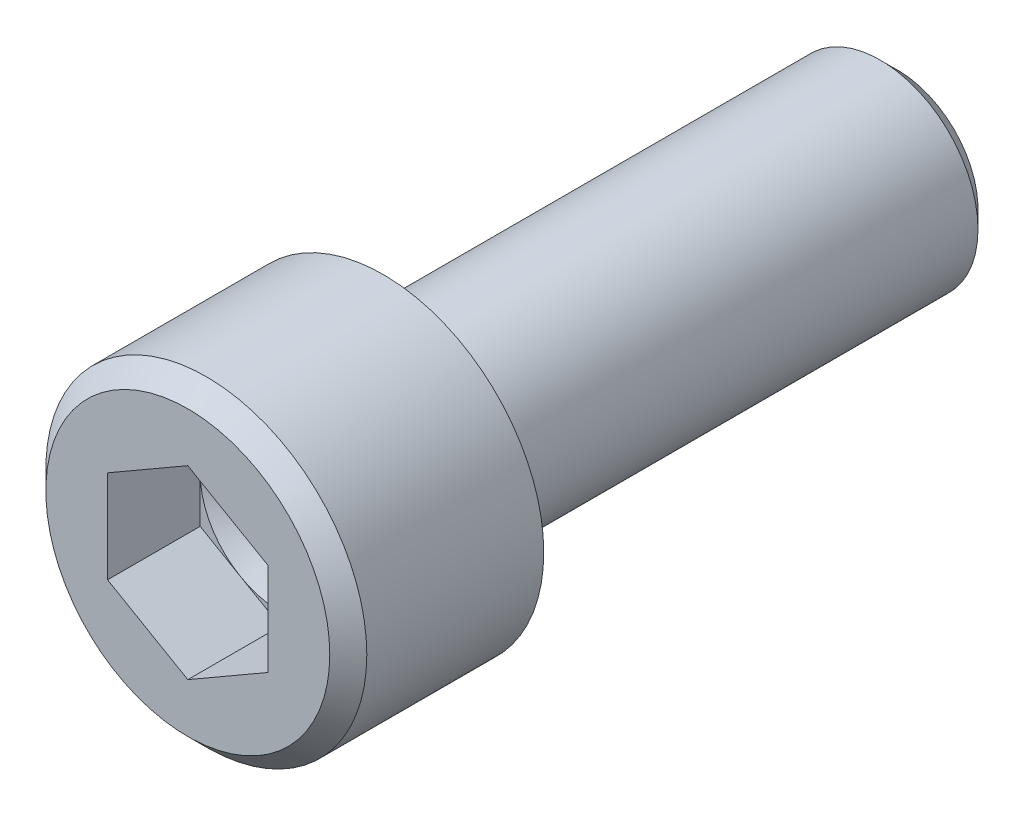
ISO-10303-21;
HEADER;
FILE_DESCRIPTION(('STEP AP214'),'2;1');
FILE_NAME('part.step','',(''),(''),'','','');
FILE_SCHEMA(('AUTOMOTIVE_DESIGN { 1 0 10303 214 1 1 1 1 }'));
ENDSEC;
DATA;
#1=APPLICATION_CONTEXT('core data for automotive mechanical design processes');
#2=APPLICATION_PROTOCOL_DEFINITION('international standard','automotive_design',2000,#1);
#3=PRODUCT_CONTEXT('',#1,'mechanical');
#4=PRODUCT('Part','Part','',(#3));
#5=PRODUCT_RELATED_PRODUCT_CATEGORY('part','',(#4));
#6=PRODUCT_DEFINITION_FORMATION('','',#4);
#7=PRODUCT_DEFINITION_CONTEXT('part definition',#1,'design');
#8=PRODUCT_DEFINITION('design','',#6,#7);
#9=PRODUCT_DEFINITION_SHAPE('','',#8);
#10=(LENGTH_UNIT() NAMED_UNIT(*) SI_UNIT(.MILLI.,.METRE.));
#11=(NAMED_UNIT(*) PLANE_ANGLE_UNIT() SI_UNIT($,.RADIAN.));
#12=(NAMED_UNIT(*) SI_UNIT($,.STERADIAN.) SOLID_ANGLE_UNIT());
#13=UNCERTAINTY_MEASURE_WITH_UNIT(LENGTH_MEASURE(1.E-05),#10,'distance_accuracy_value','');
#14=(GEOMETRIC_REPRESENTATION_CONTEXT(3) GLOBAL_UNCERTAINTY_ASSIGNED_CONTEXT((#13)) GLOBAL_UNIT_ASSIGNED_CONTEXT((#10,
#11,#12)) REPRESENTATION_CONTEXT('',''));
#15=CARTESIAN_POINT('',(0.,0.,0.));
#16=DIRECTION('',(0.,0.,1.));
#17=DIRECTION('',(1.,0.,0.));
#18=AXIS2_PLACEMENT_3D('',#15,#16,#17);
#19=CARTESIAN_POINT('',(0.,0.,-12.7));
#20=DIRECTION('',(0.,0.,1.));
#21=DIRECTION('',(1.,0.,0.));
#22=AXIS2_PLACEMENT_3D('',#19,#20,#21);
#23=CONICAL_SURFACE('',#22,1.98405761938,0.785398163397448);
#24=CARTESIAN_POINT('',(0.,0.,-12.7));
#25=DIRECTION('',(0.,0.,-1.));
#26=DIRECTION('',(-1.,0.,0.));
#27=AXIS2_PLACEMENT_3D('',#24,#25,#26);
#28=CIRCLE('',#27,1.98405761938);
#29=CARTESIAN_POINT('',(-1.98405761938,0.,-12.7));
#30=VERTEX_POINT('',#29);
#31=EDGE_CURVE('E11',#30,#30,#28,.T.);
#32=ORIENTED_EDGE('',*,*,#31,.F.);
#33=EDGE_LOOP('',(#32));
#34=FACE_BOUND('',#33,.T.);
#35=CARTESIAN_POINT('',(0.,0.,-12.27105761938));
#36=DIRECTION('',(0.,0.,1.));
#37=DIRECTION('',(-1.,0.,0.));
#38=AXIS2_PLACEMENT_3D('',#35,#36,#37);
#39=CIRCLE('',#38,2.413);
#40=CARTESIAN_POINT('',(-2.413,0.,-12.27105761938));
#41=VERTEX_POINT('',#40);
#42=EDGE_CURVE('E272',#41,#41,#39,.T.);
#43=ORIENTED_EDGE('',*,*,#42,.F.);
#44=EDGE_LOOP('',(#43));
#45=FACE_BOUND('',#44,.T.);
#46=ADVANCED_FACE('F17',(#34,#45),#23,.T.);
#47=CARTESIAN_POINT('',(0.,0.,-0.1524));
#48=DIRECTION('',(0.,0.,1.));
#49=DIRECTION('',(1.,0.,0.));
#50=AXIS2_PLACEMENT_3D('',#47,#48,#49);
#51=TOROIDAL_SURFACE('',#50,2.5654,0.1524);
#52=CARTESIAN_POINT('',(0.,0.,-0.1524));
#53=DIRECTION('',(0.,0.,-1.));
#54=DIRECTION('',(1.,0.,0.));
#55=AXIS2_PLACEMENT_3D('',#52,#53,#54);
#56=CIRCLE('',#55,2.413);
#57=CARTESIAN_POINT('',(2.413,0.,-0.1524));
#58=VERTEX_POINT('',#57);
#59=EDGE_CURVE('E27',#58,#58,#56,.T.);
#60=ORIENTED_EDGE('',*,*,#59,.F.);
#61=EDGE_LOOP('',(#60));
#62=FACE_BOUND('',#61,.T.);
#63=CARTESIAN_POINT('',(0.,0.,0.));
#64=DIRECTION('',(0.,0.,1.));
#65=DIRECTION('',(1.,0.,0.));
#66=AXIS2_PLACEMENT_3D('',#63,#64,#65);
#67=CIRCLE('',#66,2.5654);
#68=CARTESIAN_POINT('',(2.5654,0.,0.));
#69=VERTEX_POINT('',#68);
#70=EDGE_CURVE('E176',#69,#69,#67,.T.);
#71=ORIENTED_EDGE('',*,*,#70,.F.);
#72=EDGE_LOOP('',(#71));
#73=FACE_BOUND('',#72,.T.);
#74=ADVANCED_FACE('F19',(#62,#73),#51,.F.);
#75=CARTESIAN_POINT('',(0.,0.,1001.39615364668));
#76=DIRECTION('',(0.,0.,1.));
#77=DIRECTION('',(1.,0.,0.));
#78=AXIS2_PLACEMENT_3D('',#75,#76,#77);
#79=CONICAL_SURFACE('',#78,1732.05080756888,1.0471975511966);
#80=CARTESIAN_POINT('',(0.,0.,1.39615364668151));
#81=VERTEX_POINT('',#80);
#82=VERTEX_LOOP('',#81);
#83=FACE_BOUND('',#82,.T.);
#84=CARTESIAN_POINT('',(0.,0.,2.54));
#85=DIRECTION('',(0.,0.,-1.));
#86=DIRECTION('',(-1.,0.,0.));
#87=AXIS2_PLACEMENT_3D('',#84,#85,#86);
#88=CIRCLE('',#87,1.9812);
#89=CARTESIAN_POINT('',(-1.9812,0.,2.54));
#90=VERTEX_POINT('',#89);
#91=CARTESIAN_POINT('',(-0.9906,1.71576952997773,2.54));
#92=VERTEX_POINT('',#91);
#93=EDGE_CURVE('E148',#90,#92,#88,.T.);
#94=ORIENTED_EDGE('',*,*,#93,.F.);
#95=CARTESIAN_POINT('',(0.,0.,2.54));
#96=DIRECTION('',(0.,0.,-1.));
#97=DIRECTION('',(-1.,0.,0.));
#98=AXIS2_PLACEMENT_3D('',#95,#96,#97);
#99=CIRCLE('',#98,1.9812);
#100=CARTESIAN_POINT('',(-0.9906,-1.71576952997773,2.54));
#101=VERTEX_POINT('',#100);
#102=EDGE_CURVE('E135',#101,#90,#99,.T.);
#103=ORIENTED_EDGE('',*,*,#102,.F.);
#104=CARTESIAN_POINT('',(0.,0.,2.54));
#105=DIRECTION('',(0.,0.,-1.));
#106=DIRECTION('',(-1.,0.,0.));
#107=AXIS2_PLACEMENT_3D('',#104,#105,#106);
#108=CIRCLE('',#107,1.9812);
#109=CARTESIAN_POINT('',(0.9906,-1.71576952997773,2.54));
#110=VERTEX_POINT('',#109);
#111=EDGE_CURVE('E216',#110,#101,#108,.T.);
#112=ORIENTED_EDGE('',*,*,#111,.F.);
#113=CARTESIAN_POINT('',(0.,0.,2.54));
#114=DIRECTION('',(0.,0.,-1.));
#115=DIRECTION('',(-1.,0.,0.));
#116=AXIS2_PLACEMENT_3D('',#113,#114,#115);
#117=CIRCLE('',#116,1.9812);
#118=CARTESIAN_POINT('',(1.9812,0.,2.54));
#119=VERTEX_POINT('',#118);
#120=EDGE_CURVE('E170',#119,#110,#117,.T.);
#121=ORIENTED_EDGE('',*,*,#120,.F.);
#122=CARTESIAN_POINT('',(0.,0.,2.54));
#123=DIRECTION('',(0.,0.,-1.));
#124=DIRECTION('',(-1.,0.,0.));
#125=AXIS2_PLACEMENT_3D('',#122,#123,#124);
#126=CIRCLE('',#125,1.9812);
#127=CARTESIAN_POINT('',(0.9906,1.71576952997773,2.54));
#128=VERTEX_POINT('',#127);
#129=EDGE_CURVE('E171',#128,#119,#126,.T.);
#130=ORIENTED_EDGE('',*,*,#129,.F.);
#131=CARTESIAN_POINT('',(0.,0.,2.54));
#132=DIRECTION('',(0.,0.,-1.));
#133=DIRECTION('',(-1.,0.,0.));
#134=AXIS2_PLACEMENT_3D('',#131,#132,#133);
#135=CIRCLE('',#134,1.9812);
#136=EDGE_CURVE('E151',#92,#128,#135,.T.);
#137=ORIENTED_EDGE('',*,*,#136,.F.);
#138=EDGE_LOOP('',(#94,#103,#112,#121,#130,#137));
#139=FACE_BOUND('',#138,.T.);
#140=ADVANCED_FACE('F141',(#83,#139),#79,.F.);
#141=CARTESIAN_POINT('',(0.,0.,-12.7));
#142=DIRECTION('',(0.,0.,-1.));
#143=DIRECTION('',(0.,-1.,0.));
#144=AXIS2_PLACEMENT_3D('',#141,#142,#143);
#145=PLANE('',#144);
#146=ORIENTED_EDGE('',*,*,#31,.T.);
#147=EDGE_LOOP('',(#146));
#148=FACE_BOUND('',#147,.T.);
#149=ADVANCED_FACE('F144',(#148),#145,.T.);
#150=CARTESIAN_POINT('',(0.,0.,-12.7));
#151=DIRECTION('',(0.,0.,1.));
#152=DIRECTION('',(1.,0.,0.));
#153=AXIS2_PLACEMENT_3D('',#150,#151,#152);
#154=CYLINDRICAL_SURFACE('',#153,2.413);
#155=ORIENTED_EDGE('',*,*,#59,.T.);
#156=EDGE_LOOP('',(#155));
#157=FACE_BOUND('',#156,.T.);
#158=ORIENTED_EDGE('',*,*,#42,.T.);
#159=EDGE_LOOP('',(#158));
#160=FACE_BOUND('',#159,.T.);
#161=ADVANCED_FACE('F282',(#157,#160),#154,.T.);
#162=CARTESIAN_POINT('',(0.,0.,2.54));
#163=DIRECTION('',(0.,0.,1.));
#164=DIRECTION('',(1.,0.,0.));
#165=AXIS2_PLACEMENT_3D('',#162,#163,#164);
#166=PLANE('',#165);
#167=DIRECTION('',(-0.866025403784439,0.5,0.));
#168=VECTOR('',#167,1.);
#169=CARTESIAN_POINT('',(-2.14455417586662,-1.04953377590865,2.54));
#170=LINE('',#169,#168);
#171=CARTESIAN_POINT('',(-1.9812,-1.14384635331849,2.54));
#172=VERTEX_POINT('',#171);
#173=EDGE_CURVE('E226',#101,#172,#170,.T.);
#174=ORIENTED_EDGE('',*,*,#173,.F.);
#175=ORIENTED_EDGE('',*,*,#102,.T.);
#176=DIRECTION('',(0.,1.,0.));
#177=VECTOR('',#176,1.);
#178=CARTESIAN_POINT('',(-1.9812,0.,2.54));
#179=LINE('',#178,#177);
#180=EDGE_CURVE('E267',#172,#90,#179,.T.);
#181=ORIENTED_EDGE('',*,*,#180,.F.);
#182=EDGE_LOOP('',(#174,#175,#181));
#183=FACE_BOUND('',#182,.T.);
#184=ADVANCED_FACE('F321',(#183),#166,.T.);
#185=CARTESIAN_POINT('',(1.9812,0.,2.54));
#186=DIRECTION('',(-1.,0.,0.));
#187=DIRECTION('',(0.,1.,0.));
#188=AXIS2_PLACEMENT_3D('',#185,#186,#187);
#189=PLANE('',#188);
#190=DIRECTION('',(0.,-1.,0.));
#191=VECTOR('',#190,1.);
#192=CARTESIAN_POINT('',(1.9812,0.,4.826));
#193=LINE('',#192,#191);
#194=CARTESIAN_POINT('',(1.9812,1.14384635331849,4.826));
#195=VERTEX_POINT('',#194);
#196=CARTESIAN_POINT('',(1.9812,-1.14384635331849,4.826));
#197=VERTEX_POINT('',#196);
#198=EDGE_CURVE('E209',#195,#197,#193,.T.);
#199=ORIENTED_EDGE('',*,*,#198,.F.);
#200=DIRECTION('',(0.,0.,1.));
#201=VECTOR('',#200,1.);
#202=CARTESIAN_POINT('',(1.9812,1.14384635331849,2.54));
#203=LINE('',#202,#201);
#204=CARTESIAN_POINT('',(1.9812,1.14384635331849,2.54));
#205=VERTEX_POINT('',#204);
#206=EDGE_CURVE('E183',#205,#195,#203,.T.);
#207=ORIENTED_EDGE('',*,*,#206,.F.);
#208=DIRECTION('',(0.,-1.,0.));
#209=VECTOR('',#208,1.);
#210=CARTESIAN_POINT('',(1.9812,0.,2.54));
#211=LINE('',#210,#209);
#212=EDGE_CURVE('E174',#205,#119,#211,.T.);
#213=ORIENTED_EDGE('',*,*,#212,.T.);
#214=DIRECTION('',(0.,-1.,0.));
#215=VECTOR('',#214,1.);
#216=CARTESIAN_POINT('',(1.9812,0.,2.54));
#217=LINE('',#216,#215);
#218=CARTESIAN_POINT('',(1.9812,-1.14384635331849,2.54));
#219=VERTEX_POINT('',#218);
#220=EDGE_CURVE('E225',#119,#219,#217,.T.);
#221=ORIENTED_EDGE('',*,*,#220,.T.);
#222=DIRECTION('',(0.,0.,1.));
#223=VECTOR('',#222,1.);
#224=CARTESIAN_POINT('',(1.9812,-1.14384635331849,2.54));
#225=LINE('',#224,#223);
#226=EDGE_CURVE('E229',#219,#197,#225,.T.);
#227=ORIENTED_EDGE('',*,*,#226,.T.);
#228=EDGE_LOOP('',(#199,#207,#213,#221,#227));
#229=FACE_BOUND('',#228,.T.);
#230=ADVANCED_FACE('F335',(#229),#189,.T.);
#231=CARTESIAN_POINT('',(2.14455417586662,-1.04953377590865,2.54));
#232=DIRECTION('',(-0.5,0.866025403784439,0.));
#233=DIRECTION('',(0.,0.,1.));
#234=AXIS2_PLACEMENT_3D('',#231,#232,#233);
#235=PLANE('',#234);
#236=DIRECTION('',(-0.866025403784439,-0.5,0.));
#237=VECTOR('',#236,1.);
#238=CARTESIAN_POINT('',(2.14455417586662,-1.04953377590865,4.826));
#239=LINE('',#238,#237);
#240=CARTESIAN_POINT('',(0.,-2.28769270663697,4.826));
#241=VERTEX_POINT('',#240);
#242=EDGE_CURVE('E248',#197,#241,#239,.T.);
#243=ORIENTED_EDGE('',*,*,#242,.F.);
#244=ORIENTED_EDGE('',*,*,#226,.F.);
#245=DIRECTION('',(-0.866025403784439,-0.5,0.));
#246=VECTOR('',#245,1.);
#247=CARTESIAN_POINT('',(2.14455417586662,-1.04953377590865,2.54));
#248=LINE('',#247,#246);
#249=EDGE_CURVE('E197',#219,#110,#248,.T.);
#250=ORIENTED_EDGE('',*,*,#249,.T.);
#251=DIRECTION('',(-0.866025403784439,-0.5,0.));
#252=VECTOR('',#251,1.);
#253=CARTESIAN_POINT('',(2.14455417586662,-1.04953377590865,2.54));
#254=LINE('',#253,#252);
#255=CARTESIAN_POINT('',(0.,-2.28769270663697,2.54));
#256=VERTEX_POINT('',#255);
#257=EDGE_CURVE('E201',#110,#256,#254,.T.);
#258=ORIENTED_EDGE('',*,*,#257,.T.);
#259=DIRECTION('',(0.,0.,1.));
#260=VECTOR('',#259,1.);
#261=CARTESIAN_POINT('',(0.,-2.28769270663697,2.54));
#262=LINE('',#261,#260);
#263=EDGE_CURVE('E230',#256,#241,#262,.T.);
#264=ORIENTED_EDGE('',*,*,#263,.T.);
#265=EDGE_LOOP('',(#243,#244,#250,#258,#264));
#266=FACE_BOUND('',#265,.T.);
#267=ADVANCED_FACE('F326',(#266),#235,.T.);
#268=CARTESIAN_POINT('',(-2.14455417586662,-1.04953377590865,2.54));
#269=DIRECTION('',(0.5,0.866025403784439,0.));
#270=DIRECTION('',(0.,0.,-1.));
#271=AXIS2_PLACEMENT_3D('',#268,#269,#270);
#272=PLANE('',#271);
#273=DIRECTION('',(-0.866025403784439,0.5,0.));
#274=VECTOR('',#273,1.);
#275=CARTESIAN_POINT('',(-2.14455417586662,-1.04953377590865,4.826));
#276=LINE('',#275,#274);
#277=CARTESIAN_POINT('',(-1.9812,-1.14384635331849,4.826));
#278=VERTEX_POINT('',#277);
#279=EDGE_CURVE('E252',#241,#278,#276,.T.);
#280=ORIENTED_EDGE('',*,*,#279,.F.);
#281=ORIENTED_EDGE('',*,*,#263,.F.);
#282=DIRECTION('',(-0.866025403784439,0.5,0.));
#283=VECTOR('',#282,1.);
#284=CARTESIAN_POINT('',(-2.14455417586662,-1.04953377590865,2.54));
#285=LINE('',#284,#283);
#286=EDGE_CURVE('E211',#256,#101,#285,.T.);
#287=ORIENTED_EDGE('',*,*,#286,.T.);
#288=ORIENTED_EDGE('',*,*,#173,.T.);
#289=DIRECTION('',(0.,0.,1.));
#290=VECTOR('',#289,1.);
#291=CARTESIAN_POINT('',(-1.9812,-1.14384635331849,2.54));
#292=LINE('',#291,#290);
#293=EDGE_CURVE('E264',#172,#278,#292,.T.);
#294=ORIENTED_EDGE('',*,*,#293,.T.);
#295=EDGE_LOOP('',(#280,#281,#287,#288,#294));
#296=FACE_BOUND('',#295,.T.);
#297=ADVANCED_FACE('F322',(#296),#272,.T.);
#298=CARTESIAN_POINT('',(-1.9812,0.,2.54));
#299=DIRECTION('',(1.,0.,0.));
#300=DIRECTION('',(0.,1.,0.));
#301=AXIS2_PLACEMENT_3D('',#298,#299,#300);
#302=PLANE('',#301);
#303=DIRECTION('',(0.,1.,0.));
#304=VECTOR('',#303,1.);
#305=CARTESIAN_POINT('',(-1.9812,0.,4.826));
#306=LINE('',#305,#304);
#307=CARTESIAN_POINT('',(-1.9812,1.14384635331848,4.826));
#308=VERTEX_POINT('',#307);
#309=EDGE_CURVE('E256',#278,#308,#306,.T.);
#310=ORIENTED_EDGE('',*,*,#309,.F.);
#311=ORIENTED_EDGE('',*,*,#293,.F.);
#312=ORIENTED_EDGE('',*,*,#180,.T.);
#313=DIRECTION('',(0.,1.,0.));
#314=VECTOR('',#313,1.);
#315=CARTESIAN_POINT('',(-1.9812,0.,2.54));
#316=LINE('',#315,#314);
#317=CARTESIAN_POINT('',(-1.9812,1.14384635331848,2.54));
#318=VERTEX_POINT('',#317);
#319=EDGE_CURVE('E157',#90,#318,#316,.T.);
#320=ORIENTED_EDGE('',*,*,#319,.T.);
#321=DIRECTION('',(0.,0.,1.));
#322=VECTOR('',#321,1.);
#323=CARTESIAN_POINT('',(-1.9812,1.14384635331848,2.54));
#324=LINE('',#323,#322);
#325=EDGE_CURVE('E196',#318,#308,#324,.T.);
#326=ORIENTED_EDGE('',*,*,#325,.T.);
#327=EDGE_LOOP('',(#310,#311,#312,#320,#326));
#328=FACE_BOUND('',#327,.T.);
#329=ADVANCED_FACE('F325',(#328),#302,.T.);
#330=CARTESIAN_POINT('',(0.163354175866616,2.38200528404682,2.54));
#331=DIRECTION('',(0.5,-0.866025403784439,0.));
#332=DIRECTION('',(0.,0.,-1.));
#333=AXIS2_PLACEMENT_3D('',#330,#331,#332);
#334=PLANE('',#333);
#335=DIRECTION('',(0.866025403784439,0.5,0.));
#336=VECTOR('',#335,1.);
#337=CARTESIAN_POINT('',(0.163354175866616,2.38200528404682,4.826));
#338=LINE('',#337,#336);
#339=CARTESIAN_POINT('',(0.,2.28769270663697,4.826));
#340=VERTEX_POINT('',#339);
#341=EDGE_CURVE('E210',#308,#340,#338,.T.);
#342=ORIENTED_EDGE('',*,*,#341,.F.);
#343=ORIENTED_EDGE('',*,*,#325,.F.);
#344=DIRECTION('',(0.866025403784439,0.5,0.));
#345=VECTOR('',#344,1.);
#346=CARTESIAN_POINT('',(0.163354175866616,2.38200528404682,2.54));
#347=LINE('',#346,#345);
#348=EDGE_CURVE('E156',#318,#92,#347,.T.);
#349=ORIENTED_EDGE('',*,*,#348,.T.);
#350=DIRECTION('',(0.866025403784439,0.5,0.));
#351=VECTOR('',#350,1.);
#352=CARTESIAN_POINT('',(0.163354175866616,2.38200528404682,2.54));
#353=LINE('',#352,#351);
#354=CARTESIAN_POINT('',(0.,2.28769270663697,2.54));
#355=VERTEX_POINT('',#354);
#356=EDGE_CURVE('E189',#92,#355,#353,.T.);
#357=ORIENTED_EDGE('',*,*,#356,.T.);
#358=DIRECTION('',(0.,0.,1.));
#359=VECTOR('',#358,1.);
#360=CARTESIAN_POINT('',(0.,2.28769270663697,2.54));
#361=LINE('',#360,#359);
#362=EDGE_CURVE('E178',#355,#340,#361,.T.);
#363=ORIENTED_EDGE('',*,*,#362,.T.);
#364=EDGE_LOOP('',(#342,#343,#349,#357,#363));
#365=FACE_BOUND('',#364,.T.);
#366=ADVANCED_FACE('F330',(#365),#334,.T.);
#367=CARTESIAN_POINT('',(-0.163354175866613,2.38200528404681,2.54));
#368=DIRECTION('',(-0.5,-0.866025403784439,0.));
#369=DIRECTION('',(-0.866025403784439,0.5,0.));
#370=AXIS2_PLACEMENT_3D('',#367,#368,#369);
#371=PLANE('',#370);
#372=DIRECTION('',(0.866025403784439,-0.5,0.));
#373=VECTOR('',#372,1.);
#374=CARTESIAN_POINT('',(-0.163354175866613,2.38200528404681,4.826));
#375=LINE('',#374,#373);
#376=EDGE_CURVE('E205',#340,#195,#375,.T.);
#377=ORIENTED_EDGE('',*,*,#376,.F.);
#378=ORIENTED_EDGE('',*,*,#362,.F.);
#379=DIRECTION('',(0.866025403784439,-0.5,0.));
#380=VECTOR('',#379,1.);
#381=CARTESIAN_POINT('',(-0.163354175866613,2.38200528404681,2.54));
#382=LINE('',#381,#380);
#383=EDGE_CURVE('E193',#355,#128,#382,.T.);
#384=ORIENTED_EDGE('',*,*,#383,.T.);
#385=DIRECTION('',(0.866025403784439,-0.5,0.));
#386=VECTOR('',#385,1.);
#387=CARTESIAN_POINT('',(-0.163354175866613,2.38200528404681,2.54));
#388=LINE('',#387,#386);
#389=EDGE_CURVE('E175',#128,#205,#388,.T.);
#390=ORIENTED_EDGE('',*,*,#389,.T.);
#391=ORIENTED_EDGE('',*,*,#206,.T.);
#392=EDGE_LOOP('',(#377,#378,#384,#390,#391));
#393=FACE_BOUND('',#392,.T.);
#394=ADVANCED_FACE('F304',(#393),#371,.T.);
#395=CARTESIAN_POINT('',(0.,0.,4.826));
#396=DIRECTION('',(0.,0.,-1.));
#397=DIRECTION('',(-1.,0.,0.));
#398=AXIS2_PLACEMENT_3D('',#395,#396,#397);
#399=CONICAL_SURFACE('',#398,3.5052,0.785398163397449);
#400=CARTESIAN_POINT('',(0.,0.,4.826));
#401=DIRECTION('',(0.,0.,1.));
#402=DIRECTION('',(1.,0.,0.));
#403=AXIS2_PLACEMENT_3D('',#400,#401,#402);
#404=CIRCLE('',#403,3.5052);
#405=CARTESIAN_POINT('',(3.5052,0.,4.826));
#406=VERTEX_POINT('',#405);
#407=EDGE_CURVE('E215',#406,#406,#404,.T.);
#408=ORIENTED_EDGE('',*,*,#407,.F.);
#409=EDGE_LOOP('',(#408));
#410=FACE_BOUND('',#409,.T.);
#411=CARTESIAN_POINT('',(0.,0.,4.3688));
#412=DIRECTION('',(0.,0.,-1.));
#413=DIRECTION('',(1.,0.,0.));
#414=AXIS2_PLACEMENT_3D('',#411,#412,#413);
#415=CIRCLE('',#414,3.9624);
#416=CARTESIAN_POINT('',(3.9624,0.,4.3688));
#417=VERTEX_POINT('',#416);
#418=EDGE_CURVE('E186',#417,#417,#415,.T.);
#419=ORIENTED_EDGE('',*,*,#418,.F.);
#420=EDGE_LOOP('',(#419));
#421=FACE_BOUND('',#420,.T.);
#422=ADVANCED_FACE('F292',(#410,#421),#399,.T.);
#423=CARTESIAN_POINT('',(0.,0.,0.));
#424=DIRECTION('',(0.,0.,1.));
#425=DIRECTION('',(1.,0.,0.));
#426=AXIS2_PLACEMENT_3D('',#423,#424,#425);
#427=PLANE('',#426);
#428=CARTESIAN_POINT('',(0.,0.,0.));
#429=DIRECTION('',(0.,0.,1.));
#430=DIRECTION('',(1.,0.,0.));
#431=AXIS2_PLACEMENT_3D('',#428,#429,#430);
#432=CIRCLE('',#431,3.9624);
#433=CARTESIAN_POINT('',(3.9624,0.,0.));
#434=VERTEX_POINT('',#433);
#435=EDGE_CURVE('E179',#434,#434,#432,.T.);
#436=ORIENTED_EDGE('',*,*,#435,.F.);
#437=EDGE_LOOP('',(#436));
#438=FACE_BOUND('',#437,.T.);
#439=ORIENTED_EDGE('',*,*,#70,.T.);
#440=EDGE_LOOP('',(#439));
#441=FACE_BOUND('',#440,.T.);
#442=ADVANCED_FACE('F289',(#438,#441),#427,.F.);
#443=CARTESIAN_POINT('',(0.,0.,4.826));
#444=DIRECTION('',(0.,0.,-1.));
#445=DIRECTION('',(-1.,0.,0.));
#446=AXIS2_PLACEMENT_3D('',#443,#444,#445);
#447=CYLINDRICAL_SURFACE('',#446,3.9624);
#448=ORIENTED_EDGE('',*,*,#435,.T.);
#449=EDGE_LOOP('',(#448));
#450=FACE_BOUND('',#449,.T.);
#451=ORIENTED_EDGE('',*,*,#418,.T.);
#452=EDGE_LOOP('',(#451));
#453=FACE_BOUND('',#452,.T.);
#454=ADVANCED_FACE('F291',(#450,#453),#447,.T.);
#455=CARTESIAN_POINT('',(0.,0.,4.826));
#456=DIRECTION('',(0.,0.,1.));
#457=DIRECTION('',(1.,0.,0.));
#458=AXIS2_PLACEMENT_3D('',#455,#456,#457);
#459=PLANE('',#458);
#460=ORIENTED_EDGE('',*,*,#341,.T.);
#461=ORIENTED_EDGE('',*,*,#376,.T.);
#462=ORIENTED_EDGE('',*,*,#198,.T.);
#463=ORIENTED_EDGE('',*,*,#242,.T.);
#464=ORIENTED_EDGE('',*,*,#279,.T.);
#465=ORIENTED_EDGE('',*,*,#309,.T.);
#466=EDGE_LOOP('',(#460,#461,#462,#463,#464,#465));
#467=FACE_BOUND('',#466,.T.);
#468=ORIENTED_EDGE('',*,*,#407,.T.);
#469=EDGE_LOOP('',(#468));
#470=FACE_BOUND('',#469,.T.);
#471=ADVANCED_FACE('F301',(#467,#470),#459,.T.);
#472=CARTESIAN_POINT('',(0.,0.,2.54));
#473=DIRECTION('',(0.,0.,1.));
#474=DIRECTION('',(1.,0.,0.));
#475=AXIS2_PLACEMENT_3D('',#472,#473,#474);
#476=PLANE('',#475);
#477=ORIENTED_EDGE('',*,*,#257,.F.);
#478=ORIENTED_EDGE('',*,*,#111,.T.);
#479=ORIENTED_EDGE('',*,*,#286,.F.);
#480=EDGE_LOOP('',(#477,#478,#479));
#481=FACE_BOUND('',#480,.T.);
#482=ADVANCED_FACE('F341',(#481),#476,.T.);
#483=CARTESIAN_POINT('',(0.,0.,2.54));
#484=DIRECTION('',(0.,0.,1.));
#485=DIRECTION('',(1.,0.,0.));
#486=AXIS2_PLACEMENT_3D('',#483,#484,#485);
#487=PLANE('',#486);
#488=ORIENTED_EDGE('',*,*,#220,.F.);
#489=ORIENTED_EDGE('',*,*,#120,.T.);
#490=ORIENTED_EDGE('',*,*,#249,.F.);
#491=EDGE_LOOP('',(#488,#489,#490));
#492=FACE_BOUND('',#491,.T.);
#493=ADVANCED_FACE('F344',(#492),#487,.T.);
#494=CARTESIAN_POINT('',(0.,0.,2.54));
#495=DIRECTION('',(0.,0.,1.));
#496=DIRECTION('',(1.,0.,0.));
#497=AXIS2_PLACEMENT_3D('',#494,#495,#496);
#498=PLANE('',#497);
#499=ORIENTED_EDGE('',*,*,#389,.F.);
#500=ORIENTED_EDGE('',*,*,#129,.T.);
#501=ORIENTED_EDGE('',*,*,#212,.F.);
#502=EDGE_LOOP('',(#499,#500,#501));
#503=FACE_BOUND('',#502,.T.);
#504=ADVANCED_FACE('F351',(#503),#498,.T.);
#505=CARTESIAN_POINT('',(0.,0.,2.54));
#506=DIRECTION('',(0.,0.,1.));
#507=DIRECTION('',(1.,0.,0.));
#508=AXIS2_PLACEMENT_3D('',#505,#506,#507);
#509=PLANE('',#508);
#510=ORIENTED_EDGE('',*,*,#356,.F.);
#511=ORIENTED_EDGE('',*,*,#136,.T.);
#512=ORIENTED_EDGE('',*,*,#383,.F.);
#513=EDGE_LOOP('',(#510,#511,#512));
#514=FACE_BOUND('',#513,.T.);
#515=ADVANCED_FACE('F356',(#514),#509,.T.);
#516=CARTESIAN_POINT('',(0.,0.,2.54));
#517=DIRECTION('',(0.,0.,1.));
#518=DIRECTION('',(1.,0.,0.));
#519=AXIS2_PLACEMENT_3D('',#516,#517,#518);
#520=PLANE('',#519);
#521=ORIENTED_EDGE('',*,*,#319,.F.);
#522=ORIENTED_EDGE('',*,*,#93,.T.);
#523=ORIENTED_EDGE('',*,*,#348,.F.);
#524=EDGE_LOOP('',(#521,#522,#523));
#525=FACE_BOUND('',#524,.T.);
#526=ADVANCED_FACE('F160',(#525),#520,.T.);
#527=CLOSED_SHELL('',(#46,#74,#140,#149,#161,#184,#230,#267,#297,#329,#366,#394,#422,#442,#454,
#471,#482,#493,#504,#515,#526));
#528=MANIFOLD_SOLID_BREP('B1',#527);
#529=ADVANCED_BREP_SHAPE_REPRESENTATION('',(#18,#528),#14);
#530=SHAPE_DEFINITION_REPRESENTATION(#9,#529);
ENDSEC;
END-ISO-10303-21;
